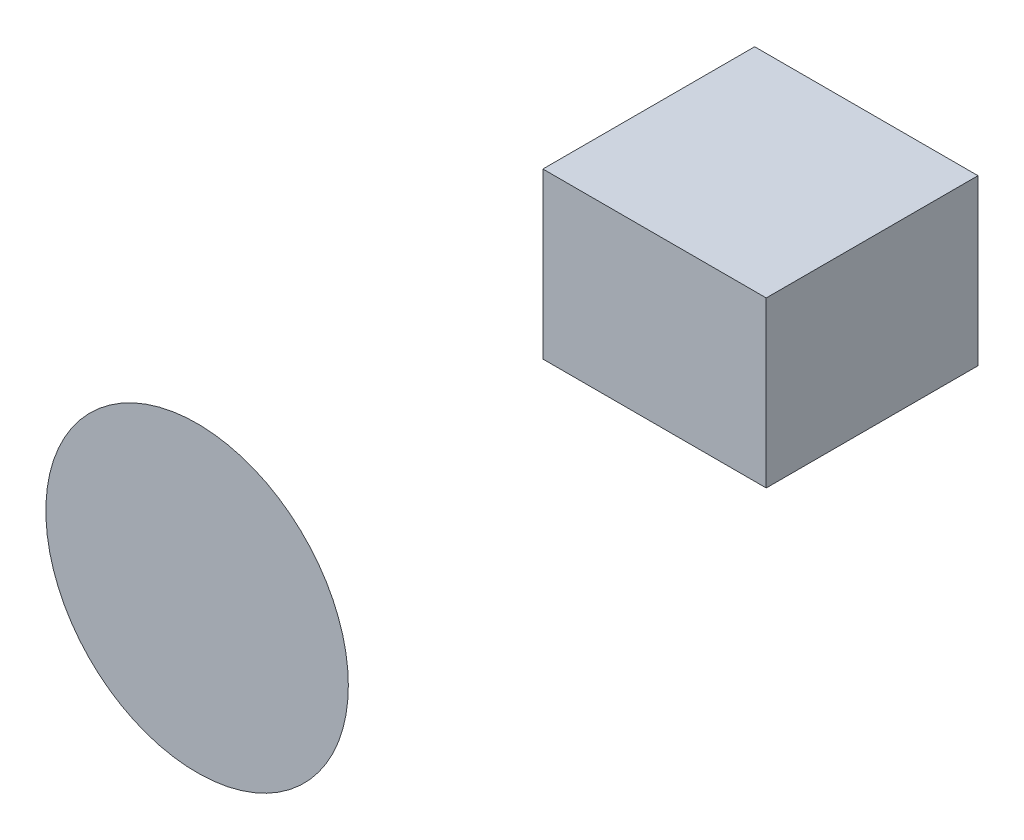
ISO-10303-21;
HEADER;
FILE_DESCRIPTION(('STEP AP214'),'2;1');
FILE_NAME('part.step','',(''),(''),'','','');
FILE_SCHEMA(('AUTOMOTIVE_DESIGN { 1 0 10303 214 1 1 1 1 }'));
ENDSEC;
DATA;
#1=APPLICATION_CONTEXT('core data for automotive mechanical design processes');
#2=APPLICATION_PROTOCOL_DEFINITION('international standard','automotive_design',2000,#1);
#3=PRODUCT_CONTEXT('',#1,'mechanical');
#4=PRODUCT('Part','Part','',(#3));
#5=PRODUCT_RELATED_PRODUCT_CATEGORY('part','',(#4));
#6=PRODUCT_DEFINITION_FORMATION('','',#4);
#7=PRODUCT_DEFINITION_CONTEXT('part definition',#1,'design');
#8=PRODUCT_DEFINITION('design','',#6,#7);
#9=PRODUCT_DEFINITION_SHAPE('','',#8);
#10=(LENGTH_UNIT() NAMED_UNIT(*) SI_UNIT(.MILLI.,.METRE.));
#11=(NAMED_UNIT(*) PLANE_ANGLE_UNIT() SI_UNIT($,.RADIAN.));
#12=(NAMED_UNIT(*) SI_UNIT($,.STERADIAN.) SOLID_ANGLE_UNIT());
#13=UNCERTAINTY_MEASURE_WITH_UNIT(LENGTH_MEASURE(1.E-05),#10,'distance_accuracy_value','');
#14=(GEOMETRIC_REPRESENTATION_CONTEXT(3) GLOBAL_UNCERTAINTY_ASSIGNED_CONTEXT((#13)) GLOBAL_UNIT_ASSIGNED_CONTEXT((#10,
#11,#12)) REPRESENTATION_CONTEXT('',''));
#15=CARTESIAN_POINT('',(0.,0.,0.));
#16=DIRECTION('',(0.,0.,1.));
#17=DIRECTION('',(1.,0.,0.));
#18=AXIS2_PLACEMENT_3D('',#15,#16,#17);
#19=CARTESIAN_POINT('',(37.8923107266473,25.6774485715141,161.900871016));
#20=DIRECTION('',(0.,0.,1.));
#21=DIRECTION('',(1.,0.,0.));
#22=AXIS2_PLACEMENT_3D('',#19,#20,#21);
#23=PLANE('',#22);
#24=CARTESIAN_POINT('',(37.8923107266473,25.6774485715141,161.900871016));
#25=DIRECTION('',(0.,0.,1.));
#26=DIRECTION('',(1.,0.,0.));
#27=AXIS2_PLACEMENT_3D('',#24,#25,#26);
#28=CIRCLE('',#27,54.2408089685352);
#29=CARTESIAN_POINT('',(92.1331196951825,25.6774485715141,161.900871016));
#30=VERTEX_POINT('',#29);
#31=EDGE_CURVE('E11',#30,#30,#28,.T.);
#32=ORIENTED_EDGE('',*,*,#31,.T.);
#33=EDGE_LOOP('',(#32));
#34=FACE_BOUND('',#33,.T.);
#35=ADVANCED_FACE('F41',(#34),#23,.T.);
#36=OPEN_SHELL('',(#35));
#37=SHELL_BASED_SURFACE_MODEL('B2',(#36));
#38=CARTESIAN_POINT('',(0.,0.,-75.946));
#39=DIRECTION('',(-1.,0.,0.));
#40=DIRECTION('',(0.,0.,1.));
#41=AXIS2_PLACEMENT_3D('',#38,#39,#40);
#42=PLANE('',#41);
#43=DIRECTION('',(0.,-1.,0.));
#44=VECTOR('',#43,1.);
#45=CARTESIAN_POINT('',(0.,0.,0.));
#46=LINE('',#45,#44);
#47=CARTESIAN_POINT('',(0.,59.0315091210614,0.));
#48=VERTEX_POINT('',#47);
#49=CARTESIAN_POINT('',(0.,0.,0.));
#50=VERTEX_POINT('',#49);
#51=EDGE_CURVE('E98',#48,#50,#46,.T.);
#52=ORIENTED_EDGE('',*,*,#51,.F.);
#53=DIRECTION('',(0.,0.,1.));
#54=VECTOR('',#53,1.);
#55=CARTESIAN_POINT('',(0.,59.0315091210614,-75.946));
#56=LINE('',#55,#54);
#57=CARTESIAN_POINT('',(0.,59.0315091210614,-75.946));
#58=VERTEX_POINT('',#57);
#59=EDGE_CURVE('E39',#58,#48,#56,.T.);
#60=ORIENTED_EDGE('',*,*,#59,.F.);
#61=DIRECTION('',(0.,-1.,0.));
#62=VECTOR('',#61,1.);
#63=CARTESIAN_POINT('',(0.,0.,-75.946));
#64=LINE('',#63,#62);
#65=CARTESIAN_POINT('',(0.,0.,-75.946));
#66=VERTEX_POINT('',#65);
#67=EDGE_CURVE('E100',#58,#66,#64,.T.);
#68=ORIENTED_EDGE('',*,*,#67,.T.);
#69=DIRECTION('',(0.,0.,1.));
#70=VECTOR('',#69,1.);
#71=CARTESIAN_POINT('',(0.,0.,-75.946));
#72=LINE('',#71,#70);
#73=EDGE_CURVE('E61',#66,#50,#72,.T.);
#74=ORIENTED_EDGE('',*,*,#73,.T.);
#75=EDGE_LOOP('',(#52,#60,#68,#74));
#76=FACE_BOUND('',#75,.T.);
#77=ADVANCED_FACE('F58',(#76),#42,.T.);
#78=CARTESIAN_POINT('',(0.,59.0315091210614,-75.946));
#79=DIRECTION('',(0.,1.,0.));
#80=DIRECTION('',(0.,0.,1.));
#81=AXIS2_PLACEMENT_3D('',#78,#79,#80);
#82=PLANE('',#81);
#83=DIRECTION('',(-1.,0.,0.));
#84=VECTOR('',#83,1.);
#85=CARTESIAN_POINT('',(0.,59.0315091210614,0.));
#86=LINE('',#85,#84);
#87=CARTESIAN_POINT('',(80.0950248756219,59.0315091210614,0.));
#88=VERTEX_POINT('',#87);
#89=EDGE_CURVE('E115',#88,#48,#86,.T.);
#90=ORIENTED_EDGE('',*,*,#89,.F.);
#91=DIRECTION('',(0.,0.,1.));
#92=VECTOR('',#91,1.);
#93=CARTESIAN_POINT('',(80.0950248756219,59.0315091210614,-75.946));
#94=LINE('',#93,#92);
#95=CARTESIAN_POINT('',(80.0950248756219,59.0315091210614,-75.946));
#96=VERTEX_POINT('',#95);
#97=EDGE_CURVE('E66',#96,#88,#94,.T.);
#98=ORIENTED_EDGE('',*,*,#97,.F.);
#99=DIRECTION('',(-1.,0.,0.));
#100=VECTOR('',#99,1.);
#101=CARTESIAN_POINT('',(0.,59.0315091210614,-75.946));
#102=LINE('',#101,#100);
#103=EDGE_CURVE('E105',#96,#58,#102,.T.);
#104=ORIENTED_EDGE('',*,*,#103,.T.);
#105=ORIENTED_EDGE('',*,*,#59,.T.);
#106=EDGE_LOOP('',(#90,#98,#104,#105));
#107=FACE_BOUND('',#106,.T.);
#108=ADVANCED_FACE('F130',(#107),#82,.T.);
#109=CARTESIAN_POINT('',(80.0950248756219,0.,-75.946));
#110=DIRECTION('',(1.,0.,0.));
#111=DIRECTION('',(0.,0.,-1.));
#112=AXIS2_PLACEMENT_3D('',#109,#110,#111);
#113=PLANE('',#112);
#114=DIRECTION('',(0.,1.,0.));
#115=VECTOR('',#114,1.);
#116=CARTESIAN_POINT('',(80.0950248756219,0.,0.));
#117=LINE('',#116,#115);
#118=CARTESIAN_POINT('',(80.0950248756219,0.,0.));
#119=VERTEX_POINT('',#118);
#120=EDGE_CURVE('E112',#119,#88,#117,.T.);
#121=ORIENTED_EDGE('',*,*,#120,.F.);
#122=DIRECTION('',(0.,0.,1.));
#123=VECTOR('',#122,1.);
#124=CARTESIAN_POINT('',(80.0950248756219,0.,-75.946));
#125=LINE('',#124,#123);
#126=CARTESIAN_POINT('',(80.0950248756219,0.,-75.946));
#127=VERTEX_POINT('',#126);
#128=EDGE_CURVE('E104',#127,#119,#125,.T.);
#129=ORIENTED_EDGE('',*,*,#128,.F.);
#130=DIRECTION('',(0.,1.,0.));
#131=VECTOR('',#130,1.);
#132=CARTESIAN_POINT('',(80.0950248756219,0.,-75.946));
#133=LINE('',#132,#131);
#134=EDGE_CURVE('E123',#127,#96,#133,.T.);
#135=ORIENTED_EDGE('',*,*,#134,.T.);
#136=ORIENTED_EDGE('',*,*,#97,.T.);
#137=EDGE_LOOP('',(#121,#129,#135,#136));
#138=FACE_BOUND('',#137,.T.);
#139=ADVANCED_FACE('F127',(#138),#113,.T.);
#140=CARTESIAN_POINT('',(0.,0.,-75.946));
#141=DIRECTION('',(0.,-1.,0.));
#142=DIRECTION('',(0.,0.,-1.));
#143=AXIS2_PLACEMENT_3D('',#140,#141,#142);
#144=PLANE('',#143);
#145=DIRECTION('',(1.,0.,0.));
#146=VECTOR('',#145,1.);
#147=CARTESIAN_POINT('',(0.,0.,0.));
#148=LINE('',#147,#146);
#149=EDGE_CURVE('E107',#50,#119,#148,.T.);
#150=ORIENTED_EDGE('',*,*,#149,.F.);
#151=ORIENTED_EDGE('',*,*,#73,.F.);
#152=DIRECTION('',(1.,0.,0.));
#153=VECTOR('',#152,1.);
#154=CARTESIAN_POINT('',(0.,0.,-75.946));
#155=LINE('',#154,#153);
#156=EDGE_CURVE('E121',#66,#127,#155,.T.);
#157=ORIENTED_EDGE('',*,*,#156,.T.);
#158=ORIENTED_EDGE('',*,*,#128,.T.);
#159=EDGE_LOOP('',(#150,#151,#157,#158));
#160=FACE_BOUND('',#159,.T.);
#161=ADVANCED_FACE('F108',(#160),#144,.T.);
#162=CARTESIAN_POINT('',(0.,59.0315091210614,-75.946));
#163=DIRECTION('',(0.,0.,-1.));
#164=DIRECTION('',(-1.,0.,0.));
#165=AXIS2_PLACEMENT_3D('',#162,#163,#164);
#166=PLANE('',#165);
#167=ORIENTED_EDGE('',*,*,#67,.F.);
#168=ORIENTED_EDGE('',*,*,#103,.F.);
#169=ORIENTED_EDGE('',*,*,#134,.F.);
#170=ORIENTED_EDGE('',*,*,#156,.F.);
#171=EDGE_LOOP('',(#167,#168,#169,#170));
#172=FACE_BOUND('',#171,.T.);
#173=ADVANCED_FACE('F132',(#172),#166,.T.);
#174=CARTESIAN_POINT('',(0.,59.0315091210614,0.));
#175=DIRECTION('',(0.,0.,-1.));
#176=DIRECTION('',(-1.,0.,0.));
#177=AXIS2_PLACEMENT_3D('',#174,#175,#176);
#178=PLANE('',#177);
#179=ORIENTED_EDGE('',*,*,#51,.T.);
#180=ORIENTED_EDGE('',*,*,#149,.T.);
#181=ORIENTED_EDGE('',*,*,#120,.T.);
#182=ORIENTED_EDGE('',*,*,#89,.T.);
#183=EDGE_LOOP('',(#179,#180,#181,#182));
#184=FACE_BOUND('',#183,.T.);
#185=ADVANCED_FACE('F114',(#184),#178,.F.);
#186=CLOSED_SHELL('',(#77,#108,#139,#161,#173,#185));
#187=MANIFOLD_SOLID_BREP('B6',#186);
#188=ADVANCED_BREP_SHAPE_REPRESENTATION('',(#18,#187),#14);
#189=MANIFOLD_SURFACE_SHAPE_REPRESENTATION('',(#18,#37),#14);
#190=SHAPE_REPRESENTATION('',(#18),#14);
#191=SHAPE_DEFINITION_REPRESENTATION(#9,#190);
#192=SHAPE_REPRESENTATION_RELATIONSHIP('','',#190,#188);
#193=SHAPE_REPRESENTATION_RELATIONSHIP('','',#190,#189);
ENDSEC;
END-ISO-10303-21;
